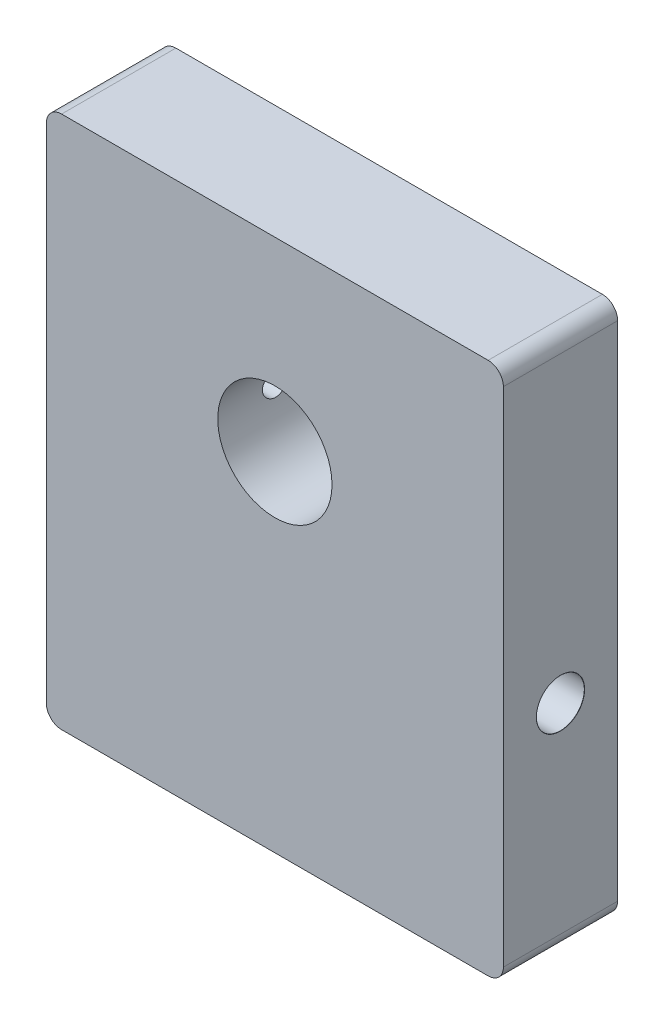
ISO-10303-21;
HEADER;
FILE_DESCRIPTION(('STEP AP214'),'2;1');
FILE_NAME('part.step','',(''),(''),'','','');
FILE_SCHEMA(('AUTOMOTIVE_DESIGN { 1 0 10303 214 1 1 1 1 }'));
ENDSEC;
DATA;
#1=APPLICATION_CONTEXT('core data for automotive mechanical design processes');
#2=APPLICATION_PROTOCOL_DEFINITION('international standard','automotive_design',2000,#1);
#3=PRODUCT_CONTEXT('',#1,'mechanical');
#4=PRODUCT('Part','Part','',(#3));
#5=PRODUCT_RELATED_PRODUCT_CATEGORY('part','',(#4));
#6=PRODUCT_DEFINITION_FORMATION('','',#4);
#7=PRODUCT_DEFINITION_CONTEXT('part definition',#1,'design');
#8=PRODUCT_DEFINITION('design','',#6,#7);
#9=PRODUCT_DEFINITION_SHAPE('','',#8);
#10=(LENGTH_UNIT() NAMED_UNIT(*) SI_UNIT(.MILLI.,.METRE.));
#11=(NAMED_UNIT(*) PLANE_ANGLE_UNIT() SI_UNIT($,.RADIAN.));
#12=(NAMED_UNIT(*) SI_UNIT($,.STERADIAN.) SOLID_ANGLE_UNIT());
#13=UNCERTAINTY_MEASURE_WITH_UNIT(LENGTH_MEASURE(1.E-05),#10,'distance_accuracy_value','');
#14=(GEOMETRIC_REPRESENTATION_CONTEXT(3) GLOBAL_UNCERTAINTY_ASSIGNED_CONTEXT((#13)) GLOBAL_UNIT_ASSIGNED_CONTEXT((#10,
#11,#12)) REPRESENTATION_CONTEXT('',''));
#15=CARTESIAN_POINT('',(0.,0.,0.));
#16=DIRECTION('',(0.,0.,1.));
#17=DIRECTION('',(1.,0.,0.));
#18=AXIS2_PLACEMENT_3D('',#15,#16,#17);
#19=CARTESIAN_POINT('',(0.,0.,19.05));
#20=DIRECTION('',(1.,0.,0.));
#21=DIRECTION('',(0.,0.,-1.));
#22=AXIS2_PLACEMENT_3D('',#19,#20,#21);
#23=PLANE('',#22);
#24=CARTESIAN_POINT('',(0.,58.42,9.525));
#25=DIRECTION('',(-1.,0.,0.));
#26=DIRECTION('',(0.,0.,1.));
#27=AXIS2_PLACEMENT_3D('',#24,#25,#26);
#28=CIRCLE('',#27,2.09977704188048);
#29=CARTESIAN_POINT('',(0.,58.42,11.6247770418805));
#30=VERTEX_POINT('',#29);
#31=EDGE_CURVE('E284',#30,#30,#28,.T.);
#32=ORIENTED_EDGE('',*,*,#31,.F.);
#33=EDGE_LOOP('',(#32));
#34=FACE_BOUND('',#33,.T.);
#35=DIRECTION('',(0.,-1.,0.));
#36=VECTOR('',#35,1.);
#37=CARTESIAN_POINT('',(0.,0.,0.));
#38=LINE('',#37,#36);
#39=CARTESIAN_POINT('',(0.,86.36,0.));
#40=VERTEX_POINT('',#39);
#41=CARTESIAN_POINT('',(0.,2.54,0.));
#42=VERTEX_POINT('',#41);
#43=EDGE_CURVE('E141',#40,#42,#38,.T.);
#44=ORIENTED_EDGE('',*,*,#43,.T.);
#45=DIRECTION('',(0.,0.,-1.));
#46=VECTOR('',#45,1.);
#47=CARTESIAN_POINT('',(0.,2.54,19.05));
#48=LINE('',#47,#46);
#49=CARTESIAN_POINT('',(0.,2.54,19.05));
#50=VERTEX_POINT('',#49);
#51=EDGE_CURVE('E180',#42,#50,#48,.F.);
#52=ORIENTED_EDGE('',*,*,#51,.T.);
#53=DIRECTION('',(0.,-1.,0.));
#54=VECTOR('',#53,1.);
#55=CARTESIAN_POINT('',(0.,0.,19.05));
#56=LINE('',#55,#54);
#57=CARTESIAN_POINT('',(0.,86.36,19.05));
#58=VERTEX_POINT('',#57);
#59=EDGE_CURVE('E144',#58,#50,#56,.T.);
#60=ORIENTED_EDGE('',*,*,#59,.F.);
#61=DIRECTION('',(0.,0.,-1.));
#62=VECTOR('',#61,1.);
#63=CARTESIAN_POINT('',(0.,86.36,19.05));
#64=LINE('',#63,#62);
#65=EDGE_CURVE('E177',#58,#40,#64,.T.);
#66=ORIENTED_EDGE('',*,*,#65,.T.);
#67=EDGE_LOOP('',(#44,#52,#60,#66));
#68=FACE_BOUND('',#67,.T.);
#69=ADVANCED_FACE('F36',(#34,#68),#23,.F.);
#70=CARTESIAN_POINT('',(0.,0.,19.05));
#71=DIRECTION('',(0.,1.,0.));
#72=DIRECTION('',(0.,0.,1.));
#73=AXIS2_PLACEMENT_3D('',#70,#71,#72);
#74=PLANE('',#73);
#75=CARTESIAN_POINT('',(38.1,0.,9.525));
#76=DIRECTION('',(0.,-1.,0.));
#77=DIRECTION('',(0.,0.,-1.));
#78=AXIS2_PLACEMENT_3D('',#75,#76,#77);
#79=CIRCLE('',#78,4.125);
#80=CARTESIAN_POINT('',(38.1,0.,5.40000000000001));
#81=VERTEX_POINT('',#80);
#82=EDGE_CURVE('E128',#81,#81,#79,.T.);
#83=ORIENTED_EDGE('',*,*,#82,.F.);
#84=EDGE_LOOP('',(#83));
#85=FACE_BOUND('',#84,.T.);
#86=DIRECTION('',(1.,0.,0.));
#87=VECTOR('',#86,1.);
#88=CARTESIAN_POINT('',(0.,0.,19.05));
#89=LINE('',#88,#87);
#90=CARTESIAN_POINT('',(2.54,0.,19.05));
#91=VERTEX_POINT('',#90);
#92=CARTESIAN_POINT('',(73.66,0.,19.05));
#93=VERTEX_POINT('',#92);
#94=EDGE_CURVE('E147',#91,#93,#89,.T.);
#95=ORIENTED_EDGE('',*,*,#94,.F.);
#96=DIRECTION('',(0.,0.,-1.));
#97=VECTOR('',#96,1.);
#98=CARTESIAN_POINT('',(2.54,0.,19.05));
#99=LINE('',#98,#97);
#100=CARTESIAN_POINT('',(2.54,0.,0.));
#101=VERTEX_POINT('',#100);
#102=EDGE_CURVE('E166',#91,#101,#99,.T.);
#103=ORIENTED_EDGE('',*,*,#102,.T.);
#104=DIRECTION('',(1.,0.,0.));
#105=VECTOR('',#104,1.);
#106=CARTESIAN_POINT('',(0.,0.,0.));
#107=LINE('',#106,#105);
#108=CARTESIAN_POINT('',(73.66,0.,0.));
#109=VERTEX_POINT('',#108);
#110=EDGE_CURVE('E158',#101,#109,#107,.T.);
#111=ORIENTED_EDGE('',*,*,#110,.T.);
#112=DIRECTION('',(0.,0.,-1.));
#113=VECTOR('',#112,1.);
#114=CARTESIAN_POINT('',(73.66,0.,19.05));
#115=LINE('',#114,#113);
#116=EDGE_CURVE('E155',#109,#93,#115,.F.);
#117=ORIENTED_EDGE('',*,*,#116,.T.);
#118=EDGE_LOOP('',(#95,#103,#111,#117));
#119=FACE_BOUND('',#118,.T.);
#120=ADVANCED_FACE('F224',(#85,#119),#74,.F.);
#121=CARTESIAN_POINT('',(76.2,0.,19.05));
#122=DIRECTION('',(-1.,0.,0.));
#123=DIRECTION('',(0.,0.,1.));
#124=AXIS2_PLACEMENT_3D('',#121,#122,#123);
#125=PLANE('',#124);
#126=CARTESIAN_POINT('',(76.2,35.8933832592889,9.525));
#127=DIRECTION('',(1.,0.,0.));
#128=DIRECTION('',(0.,0.,-1.));
#129=AXIS2_PLACEMENT_3D('',#126,#127,#128);
#130=CIRCLE('',#129,4.025);
#131=CARTESIAN_POINT('',(76.2,35.8933832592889,5.5));
#132=VERTEX_POINT('',#131);
#133=EDGE_CURVE('E121',#132,#132,#130,.T.);
#134=ORIENTED_EDGE('',*,*,#133,.F.);
#135=EDGE_LOOP('',(#134));
#136=FACE_BOUND('',#135,.T.);
#137=DIRECTION('',(0.,1.,0.));
#138=VECTOR('',#137,1.);
#139=CARTESIAN_POINT('',(76.2,0.,19.05));
#140=LINE('',#139,#138);
#141=CARTESIAN_POINT('',(76.2,2.54,19.05));
#142=VERTEX_POINT('',#141);
#143=CARTESIAN_POINT('',(76.2,86.36,19.05));
#144=VERTEX_POINT('',#143);
#145=EDGE_CURVE('E151',#142,#144,#140,.T.);
#146=ORIENTED_EDGE('',*,*,#145,.F.);
#147=DIRECTION('',(0.,0.,-1.));
#148=VECTOR('',#147,1.);
#149=CARTESIAN_POINT('',(76.2,2.54,19.05));
#150=LINE('',#149,#148);
#151=CARTESIAN_POINT('',(76.2,2.54,0.));
#152=VERTEX_POINT('',#151);
#153=EDGE_CURVE('E191',#142,#152,#150,.T.);
#154=ORIENTED_EDGE('',*,*,#153,.T.);
#155=DIRECTION('',(0.,1.,0.));
#156=VECTOR('',#155,1.);
#157=CARTESIAN_POINT('',(76.2,0.,0.));
#158=LINE('',#157,#156);
#159=CARTESIAN_POINT('',(76.2,86.36,0.));
#160=VERTEX_POINT('',#159);
#161=EDGE_CURVE('E161',#152,#160,#158,.T.);
#162=ORIENTED_EDGE('',*,*,#161,.T.);
#163=DIRECTION('',(0.,0.,-1.));
#164=VECTOR('',#163,1.);
#165=CARTESIAN_POINT('',(76.2,86.36,19.05));
#166=LINE('',#165,#164);
#167=EDGE_CURVE('E189',#160,#144,#166,.F.);
#168=ORIENTED_EDGE('',*,*,#167,.T.);
#169=EDGE_LOOP('',(#146,#154,#162,#168));
#170=FACE_BOUND('',#169,.T.);
#171=ADVANCED_FACE('F198',(#136,#170),#125,.F.);
#172=CARTESIAN_POINT('',(0.,88.9,19.05));
#173=DIRECTION('',(0.,-1.,0.));
#174=DIRECTION('',(0.,0.,-1.));
#175=AXIS2_PLACEMENT_3D('',#172,#173,#174);
#176=PLANE('',#175);
#177=DIRECTION('',(-1.,0.,0.));
#178=VECTOR('',#177,1.);
#179=CARTESIAN_POINT('',(0.,88.9,19.05));
#180=LINE('',#179,#178);
#181=CARTESIAN_POINT('',(73.66,88.9,19.05));
#182=VERTEX_POINT('',#181);
#183=CARTESIAN_POINT('',(2.54,88.9,19.05));
#184=VERTEX_POINT('',#183);
#185=EDGE_CURVE('E153',#182,#184,#180,.T.);
#186=ORIENTED_EDGE('',*,*,#185,.F.);
#187=DIRECTION('',(0.,0.,-1.));
#188=VECTOR('',#187,1.);
#189=CARTESIAN_POINT('',(73.66,88.9,19.05));
#190=LINE('',#189,#188);
#191=CARTESIAN_POINT('',(73.66,88.9,0.));
#192=VERTEX_POINT('',#191);
#193=EDGE_CURVE('E11',#182,#192,#190,.T.);
#194=ORIENTED_EDGE('',*,*,#193,.T.);
#195=DIRECTION('',(-1.,0.,0.));
#196=VECTOR('',#195,1.);
#197=CARTESIAN_POINT('',(0.,88.9,0.));
#198=LINE('',#197,#196);
#199=CARTESIAN_POINT('',(2.54,88.9,0.));
#200=VERTEX_POINT('',#199);
#201=EDGE_CURVE('E148',#192,#200,#198,.T.);
#202=ORIENTED_EDGE('',*,*,#201,.T.);
#203=DIRECTION('',(0.,0.,-1.));
#204=VECTOR('',#203,1.);
#205=CARTESIAN_POINT('',(2.54,88.9,19.05));
#206=LINE('',#205,#204);
#207=EDGE_CURVE('E50',#200,#184,#206,.F.);
#208=ORIENTED_EDGE('',*,*,#207,.T.);
#209=EDGE_LOOP('',(#186,#194,#202,#208));
#210=FACE_BOUND('',#209,.T.);
#211=ADVANCED_FACE('F209',(#210),#176,.F.);
#212=CARTESIAN_POINT('',(0.,0.,19.05));
#213=DIRECTION('',(0.,0.,-1.));
#214=DIRECTION('',(-1.,0.,0.));
#215=AXIS2_PLACEMENT_3D('',#212,#213,#214);
#216=PLANE('',#215);
#217=CARTESIAN_POINT('',(38.1,57.912,19.05));
#218=DIRECTION('',(0.,0.,1.));
#219=DIRECTION('',(1.,0.,0.));
#220=AXIS2_PLACEMENT_3D('',#217,#218,#219);
#221=CIRCLE('',#220,9.525);
#222=CARTESIAN_POINT('',(47.625,57.912,19.05));
#223=VERTEX_POINT('',#222);
#224=EDGE_CURVE('E137',#223,#223,#221,.T.);
#225=ORIENTED_EDGE('',*,*,#224,.F.);
#226=EDGE_LOOP('',(#225));
#227=FACE_BOUND('',#226,.T.);
#228=ORIENTED_EDGE('',*,*,#59,.T.);
#229=CARTESIAN_POINT('',(2.54,2.54,19.05));
#230=DIRECTION('',(0.,0.,-1.));
#231=DIRECTION('',(-1.,0.,0.));
#232=AXIS2_PLACEMENT_3D('',#229,#230,#231);
#233=CIRCLE('',#232,2.54);
#234=EDGE_CURVE('E187',#50,#91,#233,.F.);
#235=ORIENTED_EDGE('',*,*,#234,.T.);
#236=ORIENTED_EDGE('',*,*,#94,.T.);
#237=CARTESIAN_POINT('',(73.66,2.54,19.05));
#238=DIRECTION('',(0.,0.,-1.));
#239=DIRECTION('',(-1.,0.,0.));
#240=AXIS2_PLACEMENT_3D('',#237,#238,#239);
#241=CIRCLE('',#240,2.54);
#242=EDGE_CURVE('E185',#93,#142,#241,.F.);
#243=ORIENTED_EDGE('',*,*,#242,.T.);
#244=ORIENTED_EDGE('',*,*,#145,.T.);
#245=CARTESIAN_POINT('',(73.66,86.36,19.05));
#246=DIRECTION('',(0.,0.,-1.));
#247=DIRECTION('',(-1.,0.,0.));
#248=AXIS2_PLACEMENT_3D('',#245,#246,#247);
#249=CIRCLE('',#248,2.54);
#250=EDGE_CURVE('E63',#144,#182,#249,.F.);
#251=ORIENTED_EDGE('',*,*,#250,.T.);
#252=ORIENTED_EDGE('',*,*,#185,.T.);
#253=CARTESIAN_POINT('',(2.54,86.36,19.05));
#254=DIRECTION('',(0.,0.,-1.));
#255=DIRECTION('',(-1.,0.,0.));
#256=AXIS2_PLACEMENT_3D('',#253,#254,#255);
#257=CIRCLE('',#256,2.54);
#258=EDGE_CURVE('E182',#184,#58,#257,.F.);
#259=ORIENTED_EDGE('',*,*,#258,.T.);
#260=EDGE_LOOP('',(#228,#235,#236,#243,#244,#251,#252,#259));
#261=FACE_BOUND('',#260,.T.);
#262=ADVANCED_FACE('F211',(#227,#261),#216,.F.);
#263=CARTESIAN_POINT('',(0.,0.,0.));
#264=DIRECTION('',(0.,0.,-1.));
#265=DIRECTION('',(-1.,0.,0.));
#266=AXIS2_PLACEMENT_3D('',#263,#264,#265);
#267=PLANE('',#266);
#268=CARTESIAN_POINT('',(38.1,57.912,0.));
#269=DIRECTION('',(0.,0.,1.));
#270=DIRECTION('',(1.,0.,0.));
#271=AXIS2_PLACEMENT_3D('',#268,#269,#270);
#272=CIRCLE('',#271,9.525);
#273=CARTESIAN_POINT('',(47.625,57.912,0.));
#274=VERTEX_POINT('',#273);
#275=EDGE_CURVE('E138',#274,#274,#272,.T.);
#276=ORIENTED_EDGE('',*,*,#275,.T.);
#277=EDGE_LOOP('',(#276));
#278=FACE_BOUND('',#277,.T.);
#279=ORIENTED_EDGE('',*,*,#110,.F.);
#280=CARTESIAN_POINT('',(2.54,2.54,0.));
#281=DIRECTION('',(0.,0.,-1.));
#282=DIRECTION('',(-1.,0.,0.));
#283=AXIS2_PLACEMENT_3D('',#280,#281,#282);
#284=CIRCLE('',#283,2.54);
#285=EDGE_CURVE('E175',#101,#42,#284,.T.);
#286=ORIENTED_EDGE('',*,*,#285,.T.);
#287=ORIENTED_EDGE('',*,*,#43,.F.);
#288=CARTESIAN_POINT('',(2.54,86.36,0.));
#289=DIRECTION('',(0.,0.,-1.));
#290=DIRECTION('',(-1.,0.,0.));
#291=AXIS2_PLACEMENT_3D('',#288,#289,#290);
#292=CIRCLE('',#291,2.54);
#293=EDGE_CURVE('E169',#40,#200,#292,.T.);
#294=ORIENTED_EDGE('',*,*,#293,.T.);
#295=ORIENTED_EDGE('',*,*,#201,.F.);
#296=CARTESIAN_POINT('',(73.66,86.36,0.));
#297=DIRECTION('',(0.,0.,-1.));
#298=DIRECTION('',(-1.,0.,0.));
#299=AXIS2_PLACEMENT_3D('',#296,#297,#298);
#300=CIRCLE('',#299,2.54);
#301=EDGE_CURVE('E171',#192,#160,#300,.T.);
#302=ORIENTED_EDGE('',*,*,#301,.T.);
#303=ORIENTED_EDGE('',*,*,#161,.F.);
#304=CARTESIAN_POINT('',(73.66,2.54,0.));
#305=DIRECTION('',(0.,0.,-1.));
#306=DIRECTION('',(-1.,0.,0.));
#307=AXIS2_PLACEMENT_3D('',#304,#305,#306);
#308=CIRCLE('',#307,2.54);
#309=EDGE_CURVE('E173',#152,#109,#308,.T.);
#310=ORIENTED_EDGE('',*,*,#309,.T.);
#311=EDGE_LOOP('',(#279,#286,#287,#294,#295,#302,#303,#310));
#312=FACE_BOUND('',#311,.T.);
#313=ADVANCED_FACE('F204',(#278,#312),#267,.T.);
#314=CARTESIAN_POINT('',(38.1,57.912,0.));
#315=DIRECTION('',(0.,0.,1.));
#316=DIRECTION('',(1.,0.,0.));
#317=AXIS2_PLACEMENT_3D('',#314,#315,#316);
#318=CYLINDRICAL_SURFACE('',#317,9.525);
#319=CARTESIAN_POINT('',(28.5885563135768,58.42,11.6247770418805));
#320=CARTESIAN_POINT('',(28.5948279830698,58.5373813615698,11.6247727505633));
#321=CARTESIAN_POINT('',(28.6032930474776,58.6546985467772,11.6149004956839));
#322=CARTESIAN_POINT('',(28.6241935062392,58.885761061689,11.5758253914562));
#323=CARTESIAN_POINT('',(28.6366322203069,58.9995033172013,11.5466063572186));
#324=CARTESIAN_POINT('',(28.6645903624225,59.2200576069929,11.4698865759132));
#325=CARTESIAN_POINT('',(28.6801055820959,59.3268788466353,11.4224107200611));
#326=CARTESIAN_POINT('',(28.7130251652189,59.5309584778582,11.3106025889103));
#327=CARTESIAN_POINT('',(28.7304294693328,59.6282171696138,11.2462708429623));
#328=CARTESIAN_POINT('',(28.7660341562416,59.8124429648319,11.1011260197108));
#329=CARTESIAN_POINT('',(28.784243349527,59.8991826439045,11.020026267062));
#330=CARTESIAN_POINT('',(28.8195153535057,60.0578924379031,10.8442405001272));
#331=CARTESIAN_POINT('',(28.8365780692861,60.1298613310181,10.7495533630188));
#332=CARTESIAN_POINT('',(28.8680297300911,60.2573576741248,10.5484440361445));
#333=CARTESIAN_POINT('',(28.8824018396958,60.3127828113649,10.4419541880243));
#334=CARTESIAN_POINT('',(28.9068598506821,60.4048063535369,10.220670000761));
#335=CARTESIAN_POINT('',(28.9169467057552,60.4414089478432,10.1058775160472));
#336=CARTESIAN_POINT('',(28.9315207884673,60.4937313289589,9.87476339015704));
#337=CARTESIAN_POINT('',(28.93616057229,60.5100208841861,9.75858044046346));
#338=CARTESIAN_POINT('',(28.9398581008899,60.5230297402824,9.52504525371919));
#339=CARTESIAN_POINT('',(28.9389168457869,60.5197525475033,9.40769322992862));
#340=CARTESIAN_POINT('',(28.9316576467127,60.4941088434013,9.17846942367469));
#341=CARTESIAN_POINT('',(28.9254842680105,60.4722555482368,9.0665350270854));
#342=CARTESIAN_POINT('',(28.9085786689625,60.4108803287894,8.84798851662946));
#343=CARTESIAN_POINT('',(28.8978461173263,60.3713571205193,8.74137679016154));
#344=CARTESIAN_POINT('',(28.8727018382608,60.2752767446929,8.5349842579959));
#345=CARTESIAN_POINT('',(28.8582462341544,60.2185148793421,8.43530428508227));
#346=CARTESIAN_POINT('',(28.8270628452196,60.0897598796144,8.24671668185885));
#347=CARTESIAN_POINT('',(28.8103346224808,60.0177638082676,8.15781113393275));
#348=CARTESIAN_POINT('',(28.7754757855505,59.8577115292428,7.9900932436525));
#349=CARTESIAN_POINT('',(28.7573167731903,59.7691901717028,7.91173022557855));
#350=CARTESIAN_POINT('',(28.7217237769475,59.5801718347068,7.77087362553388));
#351=CARTESIAN_POINT('',(28.7042898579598,59.4796737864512,7.70838146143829));
#352=CARTESIAN_POINT('',(28.6714115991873,59.2680713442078,7.60039348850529));
#353=CARTESIAN_POINT('',(28.6559932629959,59.1568554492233,7.55510770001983));
#354=CARTESIAN_POINT('',(28.6286351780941,58.9279450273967,7.48406616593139));
#355=CARTESIAN_POINT('',(28.6166949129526,58.8102514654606,7.45830751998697));
#356=CARTESIAN_POINT('',(28.5973355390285,58.5743467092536,7.42759909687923));
#357=CARTESIAN_POINT('',(28.5898266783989,58.4561983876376,7.42222333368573));
#358=CARTESIAN_POINT('',(28.5792659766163,58.2204830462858,7.43139947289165));
#359=CARTESIAN_POINT('',(28.5762135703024,58.1029159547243,7.44594884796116));
#360=CARTESIAN_POINT('',(28.5744021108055,57.8742577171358,7.49408874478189));
#361=CARTESIAN_POINT('',(28.5755559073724,57.7630830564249,7.52728083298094));
#362=CARTESIAN_POINT('',(28.5813562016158,57.5477857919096,7.61145179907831));
#363=CARTESIAN_POINT('',(28.5860028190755,57.4436634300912,7.66243128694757));
#364=CARTESIAN_POINT('',(28.5978712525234,57.244794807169,7.78102979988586));
#365=CARTESIAN_POINT('',(28.6051065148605,57.1501008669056,7.84873512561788));
#366=CARTESIAN_POINT('',(28.6209575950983,56.9732354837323,7.99876692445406));
#367=CARTESIAN_POINT('',(28.6295735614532,56.8910653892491,8.08109496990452));
#368=CARTESIAN_POINT('',(28.6470510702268,56.740135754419,8.25968590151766));
#369=CARTESIAN_POINT('',(28.6559142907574,56.6716301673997,8.35616341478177));
#370=CARTESIAN_POINT('',(28.6724358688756,56.551729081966,8.55931926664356));
#371=CARTESIAN_POINT('',(28.6800942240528,56.50033361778,8.66599762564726));
#372=CARTESIAN_POINT('',(28.6931061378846,56.4160702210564,8.88678906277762));
#373=CARTESIAN_POINT('',(28.6984557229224,56.3832342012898,9.00091457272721));
#374=CARTESIAN_POINT('',(28.7060499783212,56.3372365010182,9.23316087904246));
#375=CARTESIAN_POINT('',(28.708294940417,56.3240729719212,9.35128129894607));
#376=CARTESIAN_POINT('',(28.709345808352,56.3178709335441,9.58655015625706));
#377=CARTESIAN_POINT('',(28.7081952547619,56.3245776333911,9.70369174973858));
#378=CARTESIAN_POINT('',(28.7027143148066,56.3573560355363,9.93515363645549));
#379=CARTESIAN_POINT('',(28.6983839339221,56.3834277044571,10.0494739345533));
#380=CARTESIAN_POINT('',(28.6871723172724,56.454068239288,10.2718308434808));
#381=CARTESIAN_POINT('',(28.6802966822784,56.4985965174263,10.3798806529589));
#382=CARTESIAN_POINT('',(28.6649642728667,56.6048675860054,10.5870319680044));
#383=CARTESIAN_POINT('',(28.6565073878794,56.6666115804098,10.6861328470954));
#384=CARTESIAN_POINT('',(28.6391070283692,56.8064936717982,10.8739022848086));
#385=CARTESIAN_POINT('',(28.6301587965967,56.884826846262,10.9624251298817));
#386=CARTESIAN_POINT('',(28.6132203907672,57.0552869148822,11.1251584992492));
#387=CARTESIAN_POINT('',(28.6052303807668,57.1474161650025,11.19936657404));
#388=CARTESIAN_POINT('',(28.5914849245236,57.3432905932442,11.3315924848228));
#389=CARTESIAN_POINT('',(28.5857377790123,57.4470771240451,11.3895499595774));
#390=CARTESIAN_POINT('',(28.5776448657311,57.6629902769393,11.4871441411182));
#391=CARTESIAN_POINT('',(28.5752961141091,57.7751094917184,11.5267968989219));
#392=CARTESIAN_POINT('',(28.5748222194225,57.9762278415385,11.5792975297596));
#393=CARTESIAN_POINT('',(28.5758028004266,58.0641565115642,11.5963335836));
#394=CARTESIAN_POINT('',(28.5802847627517,58.2414025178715,11.6190748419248));
#395=CARTESIAN_POINT('',(28.5837860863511,58.3307198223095,11.6247803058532));
#396=CARTESIAN_POINT('',(28.5885563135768,58.42,11.6247770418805));
#397=B_SPLINE_CURVE_WITH_KNOTS('',3,(#319,#320,#321,#322,#323,#324,#325,#326,#327,#328,#329,
#330,#331,#332,#333,#334,#335,#336,#337,#338,#339,#340,#341,#342,#343,#344,#345,#346,#347,#348,
#349,#350,#351,#352,#353,#354,#355,#356,#357,#358,#359,#360,#361,#362,#363,#364,#365,#366,#367,
#368,#369,#370,#371,#372,#373,#374,#375,#376,#377,#378,#379,#380,#381,#382,#383,#384,#385,#386,
#387,#388,#389,#390,#391,#392,#393,#394,#395,#396),.UNSPECIFIED.,.T.,.F.,(4,2,2,2,2,2,2,2,2,2,2,
2,2,2,2,2,2,2,2,2,2,2,2,2,2,2,2,2,2,2,2,2,2,2,2,2,2,2,4),(0.,0.352315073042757,
0.704925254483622,1.05705638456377,1.40917645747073,1.76790546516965,2.12666413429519,
2.48759759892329,2.84845069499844,3.19893614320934,3.54935878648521,3.8904034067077,
4.23147281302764,4.57676200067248,4.92211781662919,5.27928798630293,5.63649005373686,
5.99792183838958,6.35929992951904,6.7130824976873,7.06682019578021,7.4132706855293,
7.75973305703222,8.10802184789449,8.45634811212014,8.81064375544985,9.16494010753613,
9.51984382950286,9.87471419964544,10.2250539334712,10.5753930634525,10.9249658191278,
11.2745630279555,11.6285254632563,11.9825484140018,12.3378694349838,12.6928782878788,
12.9608550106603,13.2288255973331),.UNSPECIFIED.);
#398=CARTESIAN_POINT('',(28.5885563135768,58.42,11.6247770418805));
#399=VERTEX_POINT('',#398);
#400=EDGE_CURVE('E40',#399,#399,#397,.T.);
#401=ORIENTED_EDGE('',*,*,#400,.T.);
#402=EDGE_LOOP('',(#401));
#403=FACE_BOUND('',#402,.T.);
#404=ORIENTED_EDGE('',*,*,#275,.F.);
#405=EDGE_LOOP('',(#404));
#406=FACE_BOUND('',#405,.T.);
#407=ORIENTED_EDGE('',*,*,#224,.T.);
#408=EDGE_LOOP('',(#407));
#409=FACE_BOUND('',#408,.T.);
#410=ADVANCED_FACE('F252',(#403,#406,#409),#318,.F.);
#411=CARTESIAN_POINT('',(50.8,35.8933832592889,9.525));
#412=DIRECTION('',(1.,0.,0.));
#413=DIRECTION('',(0.,0.,-1.));
#414=AXIS2_PLACEMENT_3D('',#411,#412,#413);
#415=CONICAL_SURFACE('',#414,4.,1.02974425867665);
#416=CARTESIAN_POINT('',(48.3965575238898,35.8933832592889,9.525));
#417=VERTEX_POINT('',#416);
#418=VERTEX_LOOP('',#417);
#419=FACE_BOUND('',#418,.T.);
#420=CARTESIAN_POINT('',(50.8,35.8933832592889,9.525));
#421=DIRECTION('',(1.,0.,0.));
#422=DIRECTION('',(0.,0.,-1.));
#423=AXIS2_PLACEMENT_3D('',#420,#421,#422);
#424=CIRCLE('',#423,4.);
#425=CARTESIAN_POINT('',(50.8,35.8933832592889,5.525));
#426=VERTEX_POINT('',#425);
#427=EDGE_CURVE('E134',#426,#426,#424,.T.);
#428=ORIENTED_EDGE('',*,*,#427,.T.);
#429=EDGE_LOOP('',(#428));
#430=FACE_BOUND('',#429,.T.);
#431=ADVANCED_FACE('F259',(#419,#430),#415,.F.);
#432=CARTESIAN_POINT('',(76.2,35.8933832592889,9.525));
#433=DIRECTION('',(1.,0.,0.));
#434=DIRECTION('',(0.,0.,-1.));
#435=AXIS2_PLACEMENT_3D('',#432,#433,#434);
#436=CYLINDRICAL_SURFACE('',#435,4.);
#437=ORIENTED_EDGE('',*,*,#427,.F.);
#438=EDGE_LOOP('',(#437));
#439=FACE_BOUND('',#438,.T.);
#440=CARTESIAN_POINT('',(76.175,35.8933832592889,9.525));
#441=DIRECTION('',(1.,0.,0.));
#442=DIRECTION('',(0.,0.,-1.));
#443=AXIS2_PLACEMENT_3D('',#440,#441,#442);
#444=CIRCLE('',#443,4.);
#445=CARTESIAN_POINT('',(76.175,35.8933832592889,5.525));
#446=VERTEX_POINT('',#445);
#447=EDGE_CURVE('E125',#446,#446,#444,.T.);
#448=ORIENTED_EDGE('',*,*,#447,.T.);
#449=EDGE_LOOP('',(#448));
#450=FACE_BOUND('',#449,.T.);
#451=ADVANCED_FACE('F263',(#439,#450),#436,.F.);
#452=CARTESIAN_POINT('',(76.2,35.8933832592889,9.525));
#453=DIRECTION('',(1.,0.,0.));
#454=DIRECTION('',(0.,0.,-1.));
#455=AXIS2_PLACEMENT_3D('',#452,#453,#454);
#456=CONICAL_SURFACE('',#455,4.025,0.78539816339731);
#457=ORIENTED_EDGE('',*,*,#447,.F.);
#458=EDGE_LOOP('',(#457));
#459=FACE_BOUND('',#458,.T.);
#460=ORIENTED_EDGE('',*,*,#133,.T.);
#461=EDGE_LOOP('',(#460));
#462=FACE_BOUND('',#461,.T.);
#463=ADVANCED_FACE('F233',(#459,#462),#456,.F.);
#464=CARTESIAN_POINT('',(2.54,2.54,19.05));
#465=DIRECTION('',(0.,0.,-1.));
#466=DIRECTION('',(-1.,0.,0.));
#467=AXIS2_PLACEMENT_3D('',#464,#465,#466);
#468=CYLINDRICAL_SURFACE('',#467,2.54);
#469=ORIENTED_EDGE('',*,*,#234,.F.);
#470=ORIENTED_EDGE('',*,*,#51,.F.);
#471=ORIENTED_EDGE('',*,*,#285,.F.);
#472=ORIENTED_EDGE('',*,*,#102,.F.);
#473=EDGE_LOOP('',(#469,#470,#471,#472));
#474=FACE_BOUND('',#473,.T.);
#475=ADVANCED_FACE('F221',(#474),#468,.T.);
#476=CARTESIAN_POINT('',(73.66,2.54,19.05));
#477=DIRECTION('',(0.,0.,-1.));
#478=DIRECTION('',(-1.,0.,0.));
#479=AXIS2_PLACEMENT_3D('',#476,#477,#478);
#480=CYLINDRICAL_SURFACE('',#479,2.54);
#481=ORIENTED_EDGE('',*,*,#242,.F.);
#482=ORIENTED_EDGE('',*,*,#116,.F.);
#483=ORIENTED_EDGE('',*,*,#309,.F.);
#484=ORIENTED_EDGE('',*,*,#153,.F.);
#485=EDGE_LOOP('',(#481,#482,#483,#484));
#486=FACE_BOUND('',#485,.T.);
#487=ADVANCED_FACE('F226',(#486),#480,.T.);
#488=CARTESIAN_POINT('',(73.66,86.36,19.05));
#489=DIRECTION('',(0.,0.,-1.));
#490=DIRECTION('',(-1.,0.,0.));
#491=AXIS2_PLACEMENT_3D('',#488,#489,#490);
#492=CYLINDRICAL_SURFACE('',#491,2.54);
#493=ORIENTED_EDGE('',*,*,#250,.F.);
#494=ORIENTED_EDGE('',*,*,#167,.F.);
#495=ORIENTED_EDGE('',*,*,#301,.F.);
#496=ORIENTED_EDGE('',*,*,#193,.F.);
#497=EDGE_LOOP('',(#493,#494,#495,#496));
#498=FACE_BOUND('',#497,.T.);
#499=ADVANCED_FACE('F208',(#498),#492,.T.);
#500=CARTESIAN_POINT('',(2.54,86.36,19.05));
#501=DIRECTION('',(0.,0.,-1.));
#502=DIRECTION('',(-1.,0.,0.));
#503=AXIS2_PLACEMENT_3D('',#500,#501,#502);
#504=CYLINDRICAL_SURFACE('',#503,2.54);
#505=ORIENTED_EDGE('',*,*,#258,.F.);
#506=ORIENTED_EDGE('',*,*,#207,.F.);
#507=ORIENTED_EDGE('',*,*,#293,.F.);
#508=ORIENTED_EDGE('',*,*,#65,.F.);
#509=EDGE_LOOP('',(#505,#506,#507,#508));
#510=FACE_BOUND('',#509,.T.);
#511=ADVANCED_FACE('F38',(#510),#504,.T.);
#512=CARTESIAN_POINT('',(38.1,25.4,9.525));
#513=DIRECTION('',(0.,-1.,0.));
#514=DIRECTION('',(0.,0.,-1.));
#515=AXIS2_PLACEMENT_3D('',#512,#513,#514);
#516=CONICAL_SURFACE('',#515,4.09999999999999,1.02974425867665);
#517=CARTESIAN_POINT('',(38.1,27.863528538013,9.525));
#518=VERTEX_POINT('',#517);
#519=VERTEX_LOOP('',#518);
#520=FACE_BOUND('',#519,.T.);
#521=CARTESIAN_POINT('',(38.1,25.4,9.525));
#522=DIRECTION('',(0.,-1.,0.));
#523=DIRECTION('',(0.,0.,-1.));
#524=AXIS2_PLACEMENT_3D('',#521,#522,#523);
#525=CIRCLE('',#524,4.09999999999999);
#526=CARTESIAN_POINT('',(38.1,25.4,5.42500000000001));
#527=VERTEX_POINT('',#526);
#528=EDGE_CURVE('E119',#527,#527,#525,.T.);
#529=ORIENTED_EDGE('',*,*,#528,.T.);
#530=EDGE_LOOP('',(#529));
#531=FACE_BOUND('',#530,.T.);
#532=ADVANCED_FACE('F112',(#520,#531),#516,.F.);
#533=CARTESIAN_POINT('',(38.1,0.,9.525));
#534=DIRECTION('',(0.,-1.,0.));
#535=DIRECTION('',(0.,0.,-1.));
#536=AXIS2_PLACEMENT_3D('',#533,#534,#535);
#537=CYLINDRICAL_SURFACE('',#536,4.1);
#538=ORIENTED_EDGE('',*,*,#528,.F.);
#539=EDGE_LOOP('',(#538));
#540=FACE_BOUND('',#539,.T.);
#541=CARTESIAN_POINT('',(38.1,0.0250000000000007,9.525));
#542=DIRECTION('',(0.,-1.,0.));
#543=DIRECTION('',(0.,0.,-1.));
#544=AXIS2_PLACEMENT_3D('',#541,#542,#543);
#545=CIRCLE('',#544,4.1);
#546=CARTESIAN_POINT('',(38.1,0.0250000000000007,5.425));
#547=VERTEX_POINT('',#546);
#548=EDGE_CURVE('E122',#547,#547,#545,.T.);
#549=ORIENTED_EDGE('',*,*,#548,.T.);
#550=EDGE_LOOP('',(#549));
#551=FACE_BOUND('',#550,.T.);
#552=ADVANCED_FACE('F115',(#540,#551),#537,.F.);
#553=CARTESIAN_POINT('',(38.1,0.,9.525));
#554=DIRECTION('',(0.,-1.,0.));
#555=DIRECTION('',(0.,0.,-1.));
#556=AXIS2_PLACEMENT_3D('',#553,#554,#555);
#557=CONICAL_SURFACE('',#556,4.125,0.785398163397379);
#558=ORIENTED_EDGE('',*,*,#548,.F.);
#559=EDGE_LOOP('',(#558));
#560=FACE_BOUND('',#559,.T.);
#561=ORIENTED_EDGE('',*,*,#82,.T.);
#562=EDGE_LOOP('',(#561));
#563=FACE_BOUND('',#562,.T.);
#564=ADVANCED_FACE('F273',(#560,#563),#557,.F.);
#565=CARTESIAN_POINT('',(38.1,58.42,9.525));
#566=DIRECTION('',(-1.,0.,0.));
#567=DIRECTION('',(0.,0.,1.));
#568=AXIS2_PLACEMENT_3D('',#565,#566,#567);
#569=CYLINDRICAL_SURFACE('',#568,2.09977704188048);
#570=ORIENTED_EDGE('',*,*,#31,.T.);
#571=EDGE_LOOP('',(#570));
#572=FACE_BOUND('',#571,.T.);
#573=ORIENTED_EDGE('',*,*,#400,.F.);
#574=EDGE_LOOP('',(#573));
#575=FACE_BOUND('',#574,.T.);
#576=ADVANCED_FACE('F275',(#572,#575),#569,.F.);
#577=CLOSED_SHELL('',(#69,#120,#171,#211,#262,#313,#410,#431,#451,#463,#475,#487,#499,#511,#532,
#552,#564,#576));
#578=MANIFOLD_SOLID_BREP('B2',#577);
#579=ADVANCED_BREP_SHAPE_REPRESENTATION('',(#18,#578),#14);
#580=SHAPE_DEFINITION_REPRESENTATION(#9,#579);
ENDSEC;
END-ISO-10303-21;
